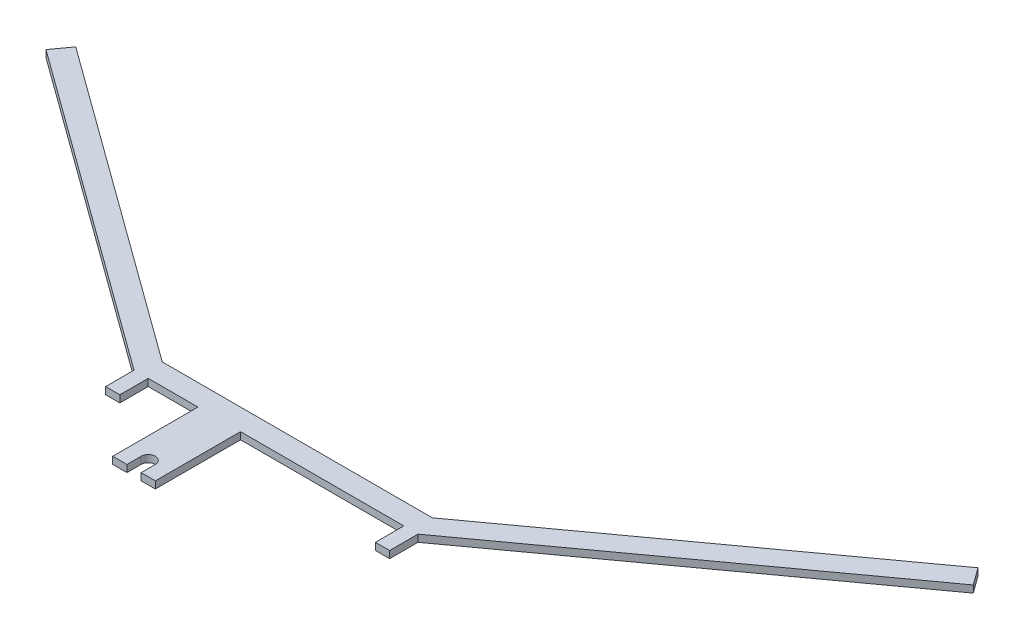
from build123d import *

# Parameters (mm, degrees)
EXTRUDE_1_DEPTH     = 0.25
SKETCH_2_W          = 1
SKETCH_2_H          = 2
EXTRUDE_2_DEPTH     = 0.5
SKETCH_5_W          = 4.537094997
SKETCH_5_H          = 4.32216947
CUT_EXTRUDE_1_DEPTH = 59.470879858
SKETCH_6_W          = 3
SKETCH_6_H          = 6
EXTRUDE_3_DEPTH     = 0.5
CUT_EXTRUDE_2_DEPTH = 62.829150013
SKETCH_8_W          = 1
SKETCH_8_H          = 2
EXTRUDE_4_DEPTH     = 0.5


with BuildPart() as part:
    # Sketch 1 → Extrude 1 (new, symmetric)
    with BuildSketch(Plane(origin=(0, 0, 0), x_dir=(1, 0, 0), z_dir=(0, 1, 0))):
        Polygon((-31.773422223, -28.831720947), (-9.512743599, -45), (9.512743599, -45), (31.773422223, -28.831720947), (32.654919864, -30.045377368), (10, -46.5), (-10, -46.5), (-32.654919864, -30.045377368), align=None)
    extrude(amount=EXTRUDE_1_DEPTH, both=True)

    # Sketch 2 → Extrude 2 (add)
    with BuildSketch(Plane(origin=(0, 0.25, 0), x_dir=(1, 0, 0), z_dir=(0, 1, 0))):
        with Locations((-9.5, -47.5)):
            Rectangle(SKETCH_2_W, SKETCH_2_H)
        with Locations((9.5, -47.5)):
            Rectangle(SKETCH_2_W, SKETCH_2_H)
    extrude(amount=-EXTRUDE_2_DEPTH)

    # Sketch 5 → Cut-Extrude 1 (cut, through all)
    with BuildSketch(Plane.XZ.offset(0.25)):
        with Locations((11.268547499, 48.661084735)):
            Rectangle(SKETCH_5_W, SKETCH_5_H)
    extrude(amount=-CUT_EXTRUDE_1_DEPTH, mode=Mode.SUBTRACT)

    # Sketch 6 → Extrude 3 (add)
    with BuildSketch(Plane.XZ.offset(0.25)):
        with Locations((-4, 49.5)):
            Rectangle(SKETCH_6_W, SKETCH_6_H)
    extrude(amount=-EXTRUDE_3_DEPTH)

    # Sketch 7 → Cut-Extrude 2 (cut, through all)
    with BuildSketch(Plane.XZ.offset(0.25)):
        with BuildLine():
            Line((-4.5, 51.5), (-4.5, 55.278413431))
            Line((-4.5, 55.278413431), (-3.5, 55.278413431))
            Line((-3.5, 55.278413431), (-3.5, 51.5))
            ThreePointArc((-3.5, 51.5), (-4, 51), (-4.5, 51.5))
        make_face()
    extrude(amount=-CUT_EXTRUDE_2_DEPTH, mode=Mode.SUBTRACT)

    # Sketch 8 → Extrude 4 (add)
    with BuildSketch(Plane.XZ.offset(0.25)):
        with Locations((9.5, 47.5)):
            Rectangle(SKETCH_8_W, SKETCH_8_H)
    extrude(amount=-EXTRUDE_4_DEPTH)


solid = part.part
